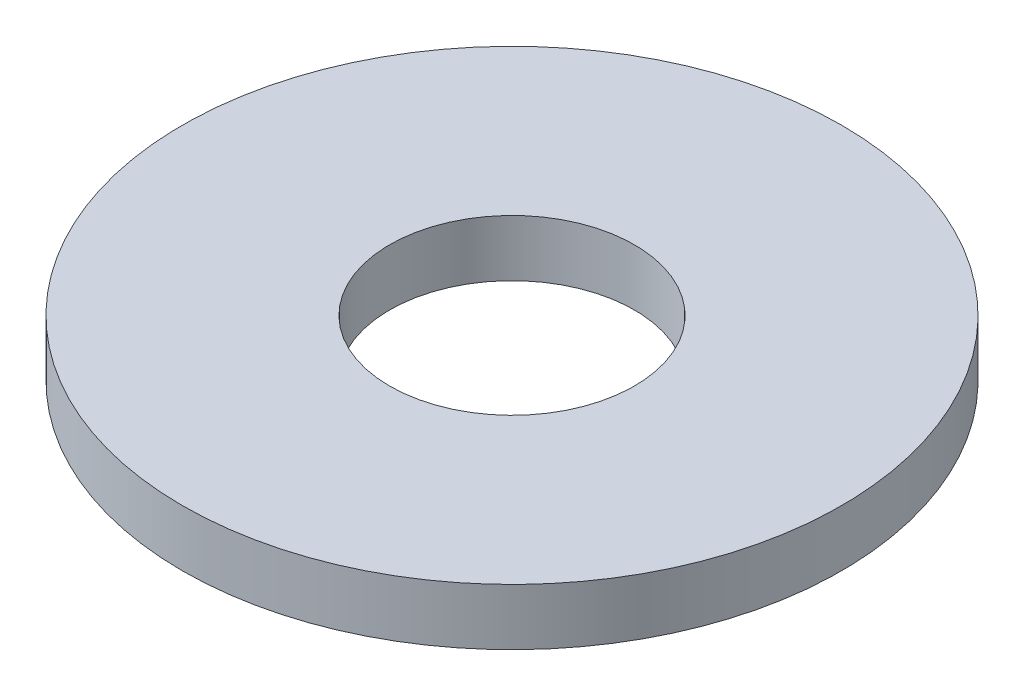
ISO-10303-21;
HEADER;
FILE_DESCRIPTION(('STEP AP214'),'2;1');
FILE_NAME('part.step','',(''),(''),'','','');
FILE_SCHEMA(('AUTOMOTIVE_DESIGN { 1 0 10303 214 1 1 1 1 }'));
ENDSEC;
DATA;
#1=APPLICATION_CONTEXT('core data for automotive mechanical design processes');
#2=APPLICATION_PROTOCOL_DEFINITION('international standard','automotive_design',2000,#1);
#3=PRODUCT_CONTEXT('',#1,'mechanical');
#4=PRODUCT('Part','Part','',(#3));
#5=PRODUCT_RELATED_PRODUCT_CATEGORY('part','',(#4));
#6=PRODUCT_DEFINITION_FORMATION('','',#4);
#7=PRODUCT_DEFINITION_CONTEXT('part definition',#1,'design');
#8=PRODUCT_DEFINITION('design','',#6,#7);
#9=PRODUCT_DEFINITION_SHAPE('','',#8);
#10=(LENGTH_UNIT() NAMED_UNIT(*) SI_UNIT(.MILLI.,.METRE.));
#11=(NAMED_UNIT(*) PLANE_ANGLE_UNIT() SI_UNIT($,.RADIAN.));
#12=(NAMED_UNIT(*) SI_UNIT($,.STERADIAN.) SOLID_ANGLE_UNIT());
#13=UNCERTAINTY_MEASURE_WITH_UNIT(LENGTH_MEASURE(1.E-05),#10,'distance_accuracy_value','');
#14=(GEOMETRIC_REPRESENTATION_CONTEXT(3) GLOBAL_UNCERTAINTY_ASSIGNED_CONTEXT((#13)) GLOBAL_UNIT_ASSIGNED_CONTEXT((#10,
#11,#12)) REPRESENTATION_CONTEXT('',''));
#15=CARTESIAN_POINT('',(0.,0.,0.));
#16=DIRECTION('',(0.,0.,1.));
#17=DIRECTION('',(1.,0.,0.));
#18=AXIS2_PLACEMENT_3D('',#15,#16,#17);
#19=CARTESIAN_POINT('',(0.,0.3,0.));
#20=DIRECTION('',(0.,1.,0.));
#21=DIRECTION('',(0.,0.,1.));
#22=AXIS2_PLACEMENT_3D('',#19,#20,#21);
#23=PLANE('',#22);
#24=CARTESIAN_POINT('',(0.,0.3,0.));
#25=DIRECTION('',(0.,1.,0.));
#26=DIRECTION('',(0.,0.,1.));
#27=AXIS2_PLACEMENT_3D('',#24,#25,#26);
#28=CIRCLE('',#27,1.75);
#29=CARTESIAN_POINT('',(0.,0.3,1.75));
#30=VERTEX_POINT('',#29);
#31=EDGE_CURVE('E10',#30,#30,#28,.T.);
#32=ORIENTED_EDGE('',*,*,#31,.T.);
#33=EDGE_LOOP('',(#32));
#34=FACE_BOUND('',#33,.T.);
#35=CARTESIAN_POINT('',(0.,0.3,0.));
#36=DIRECTION('',(0.,1.,0.));
#37=DIRECTION('',(0.,0.,1.));
#38=AXIS2_PLACEMENT_3D('',#35,#36,#37);
#39=CIRCLE('',#38,0.65);
#40=CARTESIAN_POINT('',(0.,0.3,0.65));
#41=VERTEX_POINT('',#40);
#42=EDGE_CURVE('E39',#41,#41,#39,.T.);
#43=ORIENTED_EDGE('',*,*,#42,.F.);
#44=EDGE_LOOP('',(#43));
#45=FACE_BOUND('',#44,.T.);
#46=ADVANCED_FACE('F28',(#34,#45),#23,.T.);
#47=CARTESIAN_POINT('',(0.,0.,0.));
#48=DIRECTION('',(0.,1.,0.));
#49=DIRECTION('',(0.,0.,1.));
#50=AXIS2_PLACEMENT_3D('',#47,#48,#49);
#51=PLANE('',#50);
#52=CARTESIAN_POINT('',(0.,0.,0.));
#53=DIRECTION('',(0.,1.,0.));
#54=DIRECTION('',(0.,0.,1.));
#55=AXIS2_PLACEMENT_3D('',#52,#53,#54);
#56=CIRCLE('',#55,1.75);
#57=CARTESIAN_POINT('',(0.,0.,1.75));
#58=VERTEX_POINT('',#57);
#59=EDGE_CURVE('E35',#58,#58,#56,.T.);
#60=ORIENTED_EDGE('',*,*,#59,.F.);
#61=EDGE_LOOP('',(#60));
#62=FACE_BOUND('',#61,.T.);
#63=CARTESIAN_POINT('',(0.,0.,0.));
#64=DIRECTION('',(0.,1.,0.));
#65=DIRECTION('',(0.,0.,1.));
#66=AXIS2_PLACEMENT_3D('',#63,#64,#65);
#67=CIRCLE('',#66,0.65);
#68=CARTESIAN_POINT('',(0.,0.,0.65));
#69=VERTEX_POINT('',#68);
#70=EDGE_CURVE('E43',#69,#69,#67,.T.);
#71=ORIENTED_EDGE('',*,*,#70,.T.);
#72=EDGE_LOOP('',(#71));
#73=FACE_BOUND('',#72,.T.);
#74=ADVANCED_FACE('F49',(#62,#73),#51,.F.);
#75=CARTESIAN_POINT('',(0.,0.3,0.));
#76=DIRECTION('',(0.,-1.,0.));
#77=DIRECTION('',(0.,0.,-1.));
#78=AXIS2_PLACEMENT_3D('',#75,#76,#77);
#79=CYLINDRICAL_SURFACE('',#78,1.75);
#80=ORIENTED_EDGE('',*,*,#31,.F.);
#81=EDGE_LOOP('',(#80));
#82=FACE_BOUND('',#81,.T.);
#83=ORIENTED_EDGE('',*,*,#59,.T.);
#84=EDGE_LOOP('',(#83));
#85=FACE_BOUND('',#84,.T.);
#86=ADVANCED_FACE('F30',(#82,#85),#79,.T.);
#87=CARTESIAN_POINT('',(0.,0.3,0.));
#88=DIRECTION('',(0.,-1.,0.));
#89=DIRECTION('',(0.,0.,-1.));
#90=AXIS2_PLACEMENT_3D('',#87,#88,#89);
#91=CYLINDRICAL_SURFACE('',#90,0.65);
#92=ORIENTED_EDGE('',*,*,#42,.T.);
#93=EDGE_LOOP('',(#92));
#94=FACE_BOUND('',#93,.T.);
#95=ORIENTED_EDGE('',*,*,#70,.F.);
#96=EDGE_LOOP('',(#95));
#97=FACE_BOUND('',#96,.T.);
#98=ADVANCED_FACE('F51',(#94,#97),#91,.F.);
#99=CLOSED_SHELL('',(#46,#74,#86,#98));
#100=MANIFOLD_SOLID_BREP('B2',#99);
#101=ADVANCED_BREP_SHAPE_REPRESENTATION('',(#18,#100),#14);
#102=SHAPE_DEFINITION_REPRESENTATION(#9,#101);
ENDSEC;
END-ISO-10303-21;
